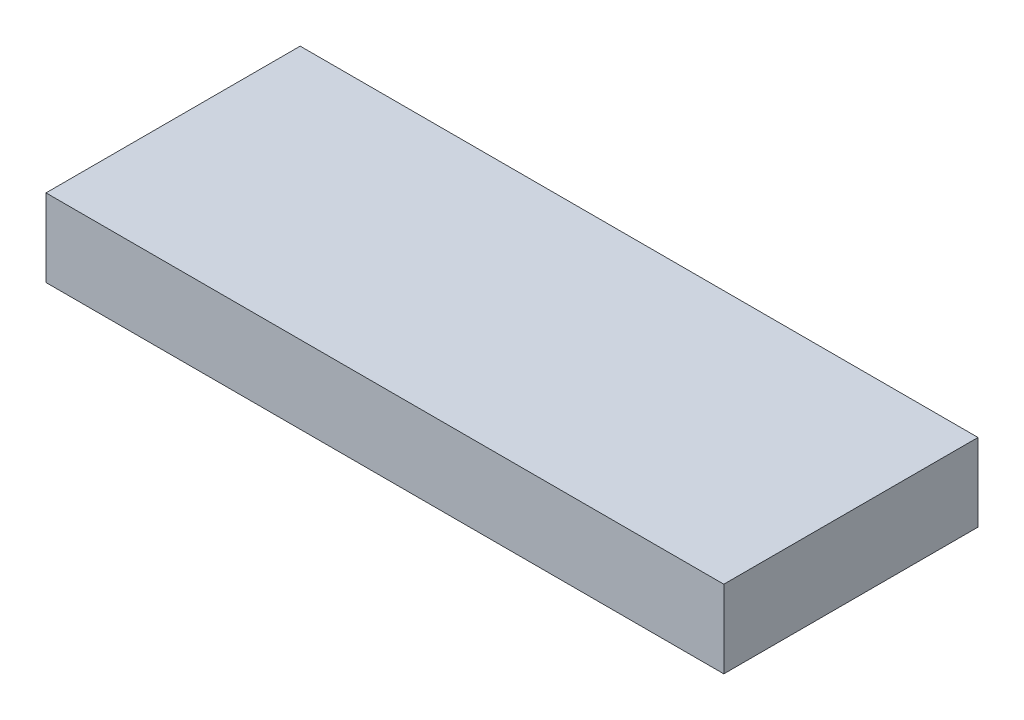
from build123d import *

# Parameters (mm, degrees)
SKETCH1_W           = 152.4
SKETCH1_H           = 17.4625
BOSS_EXTRUDE1_DEPTH = 57.15


with BuildPart() as part:
    # Sketch1 → Boss-Extrude1 (new body)
    with BuildSketch(Plane.XY):
        Rectangle(SKETCH1_W, SKETCH1_H)
    extrude(amount=-BOSS_EXTRUDE1_DEPTH)


solid = part.part
